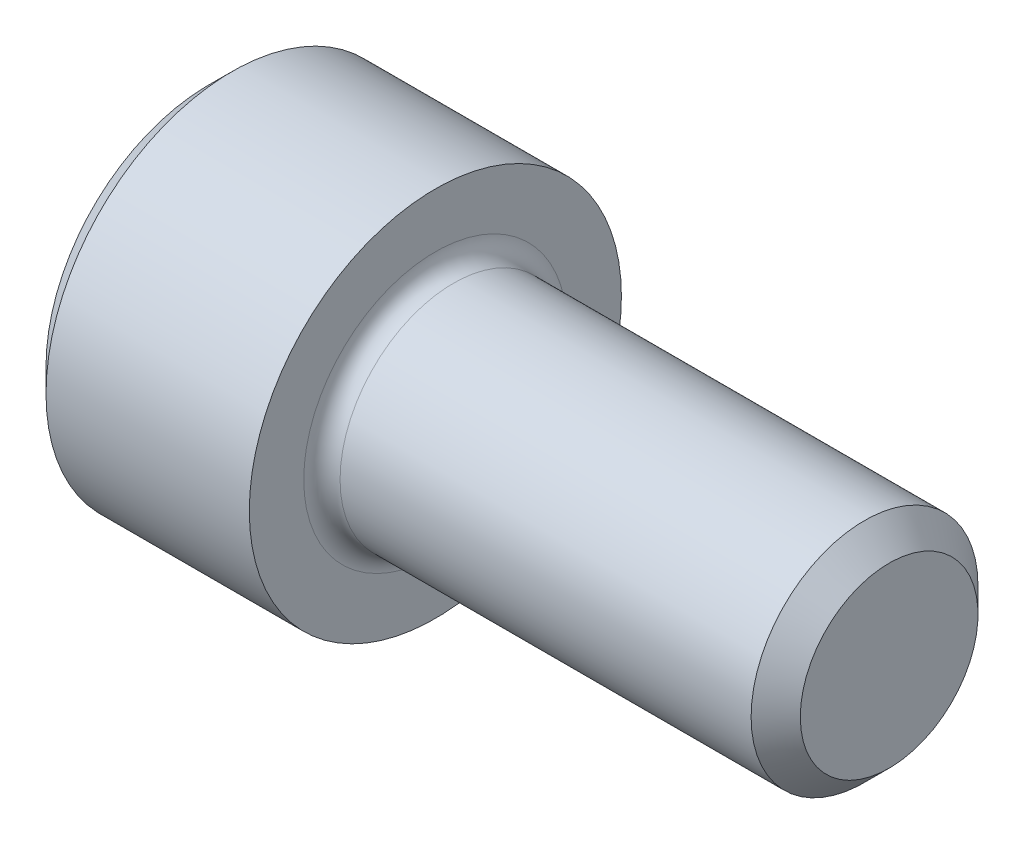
ISO-10303-21;
HEADER;
FILE_DESCRIPTION(('STEP AP214'),'2;1');
FILE_NAME('part.step','',(''),(''),'','','');
FILE_SCHEMA(('AUTOMOTIVE_DESIGN { 1 0 10303 214 1 1 1 1 }'));
ENDSEC;
DATA;
#1=APPLICATION_CONTEXT('core data for automotive mechanical design processes');
#2=APPLICATION_PROTOCOL_DEFINITION('international standard','automotive_design',2000,#1);
#3=PRODUCT_CONTEXT('',#1,'mechanical');
#4=PRODUCT('Part','Part','',(#3));
#5=PRODUCT_RELATED_PRODUCT_CATEGORY('part','',(#4));
#6=PRODUCT_DEFINITION_FORMATION('','',#4);
#7=PRODUCT_DEFINITION_CONTEXT('part definition',#1,'design');
#8=PRODUCT_DEFINITION('design','',#6,#7);
#9=PRODUCT_DEFINITION_SHAPE('','',#8);
#10=(LENGTH_UNIT() NAMED_UNIT(*) SI_UNIT(.MILLI.,.METRE.));
#11=(NAMED_UNIT(*) PLANE_ANGLE_UNIT() SI_UNIT($,.RADIAN.));
#12=(NAMED_UNIT(*) SI_UNIT($,.STERADIAN.) SOLID_ANGLE_UNIT());
#13=UNCERTAINTY_MEASURE_WITH_UNIT(LENGTH_MEASURE(1.E-05),#10,'distance_accuracy_value','');
#14=(GEOMETRIC_REPRESENTATION_CONTEXT(3) GLOBAL_UNCERTAINTY_ASSIGNED_CONTEXT((#13)) GLOBAL_UNIT_ASSIGNED_CONTEXT((#10,
#11,#12)) REPRESENTATION_CONTEXT('',''));
#15=CARTESIAN_POINT('',(0.,0.,0.));
#16=DIRECTION('',(0.,0.,1.));
#17=DIRECTION('',(1.,0.,0.));
#18=AXIS2_PLACEMENT_3D('',#15,#16,#17);
#19=CARTESIAN_POINT('',(0.,0.,0.));
#20=DIRECTION('',(-1.,0.,0.));
#21=DIRECTION('',(0.,0.,1.));
#22=AXIS2_PLACEMENT_3D('',#19,#20,#21);
#23=PLANE('',#22);
#24=DIRECTION('',(0.,-0.499999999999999,0.866025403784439));
#25=VECTOR('',#24,1.);
#26=CARTESIAN_POINT('',(0.,1.37848150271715,0.));
#27=LINE('',#26,#25);
#28=CARTESIAN_POINT('',(0.,1.37848150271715,0.));
#29=VERTEX_POINT('',#28);
#30=CARTESIAN_POINT('',(0.,0.689240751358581,1.1938));
#31=VERTEX_POINT('',#30);
#32=EDGE_CURVE('E111',#29,#31,#27,.T.);
#33=ORIENTED_EDGE('',*,*,#32,.T.);
#34=DIRECTION('',(0.,1.,0.));
#35=VECTOR('',#34,1.);
#36=CARTESIAN_POINT('',(0.,-0.689240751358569,1.1938));
#37=LINE('',#36,#35);
#38=CARTESIAN_POINT('',(0.,-0.689240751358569,1.1938));
#39=VERTEX_POINT('',#38);
#40=EDGE_CURVE('E100',#39,#31,#37,.T.);
#41=ORIENTED_EDGE('',*,*,#40,.F.);
#42=DIRECTION('',(0.,-0.500000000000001,-0.866025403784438));
#43=VECTOR('',#42,1.);
#44=CARTESIAN_POINT('',(0.,-0.689240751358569,1.1938));
#45=LINE('',#44,#43);
#46=CARTESIAN_POINT('',(0.,-1.37848150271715,0.));
#47=VERTEX_POINT('',#46);
#48=EDGE_CURVE('E110',#39,#47,#45,.T.);
#49=ORIENTED_EDGE('',*,*,#48,.T.);
#50=DIRECTION('',(0.,0.499999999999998,-0.86602540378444));
#51=VECTOR('',#50,1.);
#52=CARTESIAN_POINT('',(0.,-1.37848150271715,0.));
#53=LINE('',#52,#51);
#54=CARTESIAN_POINT('',(0.,-0.689240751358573,-1.1938));
#55=VERTEX_POINT('',#54);
#56=EDGE_CURVE('E125',#47,#55,#53,.T.);
#57=ORIENTED_EDGE('',*,*,#56,.T.);
#58=DIRECTION('',(0.,-1.,0.));
#59=VECTOR('',#58,1.);
#60=CARTESIAN_POINT('',(0.,0.689240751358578,-1.1938));
#61=LINE('',#60,#59);
#62=CARTESIAN_POINT('',(0.,0.689240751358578,-1.1938));
#63=VERTEX_POINT('',#62);
#64=EDGE_CURVE('E128',#63,#55,#61,.T.);
#65=ORIENTED_EDGE('',*,*,#64,.F.);
#66=DIRECTION('',(0.,-0.500000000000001,-0.866025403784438));
#67=VECTOR('',#66,1.);
#68=CARTESIAN_POINT('',(0.,1.37848150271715,0.));
#69=LINE('',#68,#67);
#70=EDGE_CURVE('E120',#29,#63,#69,.T.);
#71=ORIENTED_EDGE('',*,*,#70,.F.);
#72=EDGE_LOOP('',(#33,#41,#49,#57,#65,#71));
#73=FACE_BOUND('',#72,.T.);
#74=CARTESIAN_POINT('',(0.,0.,0.));
#75=DIRECTION('',(-1.,0.,0.));
#76=DIRECTION('',(0.,0.,1.));
#77=AXIS2_PLACEMENT_3D('',#74,#75,#76);
#78=CIRCLE('',#77,2.2733);
#79=CARTESIAN_POINT('',(0.,0.,2.2733));
#80=VERTEX_POINT('',#79);
#81=EDGE_CURVE('E180',#80,#80,#78,.T.);
#82=ORIENTED_EDGE('',*,*,#81,.T.);
#83=EDGE_LOOP('',(#82));
#84=FACE_BOUND('',#83,.T.);
#85=ADVANCED_FACE('F28',(#73,#84),#23,.T.);
#86=CARTESIAN_POINT('',(0.,0.,0.));
#87=DIRECTION('',(1.,0.,0.));
#88=DIRECTION('',(0.,0.,-1.));
#89=AXIS2_PLACEMENT_3D('',#86,#87,#88);
#90=CONICAL_SURFACE('',#89,2.2733,0.785398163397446);
#91=CARTESIAN_POINT('',(0.330200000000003,0.,0.));
#92=DIRECTION('',(-1.,0.,0.));
#93=DIRECTION('',(0.,0.,1.));
#94=AXIS2_PLACEMENT_3D('',#91,#92,#93);
#95=CIRCLE('',#94,2.6035);
#96=CARTESIAN_POINT('',(0.330200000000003,0.,2.6035));
#97=VERTEX_POINT('',#96);
#98=EDGE_CURVE('E177',#97,#97,#95,.T.);
#99=ORIENTED_EDGE('',*,*,#98,.T.);
#100=EDGE_LOOP('',(#99));
#101=FACE_BOUND('',#100,.T.);
#102=ORIENTED_EDGE('',*,*,#81,.F.);
#103=EDGE_LOOP('',(#102));
#104=FACE_BOUND('',#103,.T.);
#105=ADVANCED_FACE('F205',(#101,#104),#90,.T.);
#106=CARTESIAN_POINT('',(-31.75,0.,0.));
#107=DIRECTION('',(-1.,0.,0.));
#108=DIRECTION('',(0.,0.,1.));
#109=AXIS2_PLACEMENT_3D('',#106,#107,#108);
#110=CYLINDRICAL_SURFACE('',#109,2.6035);
#111=CARTESIAN_POINT('',(3.175,0.,0.));
#112=DIRECTION('',(-1.,0.,0.));
#113=DIRECTION('',(0.,0.,1.));
#114=AXIS2_PLACEMENT_3D('',#111,#112,#113);
#115=CIRCLE('',#114,2.6035);
#116=CARTESIAN_POINT('',(3.175,0.,2.6035));
#117=VERTEX_POINT('',#116);
#118=EDGE_CURVE('E174',#117,#117,#115,.T.);
#119=ORIENTED_EDGE('',*,*,#118,.T.);
#120=EDGE_LOOP('',(#119));
#121=FACE_BOUND('',#120,.T.);
#122=ORIENTED_EDGE('',*,*,#98,.F.);
#123=EDGE_LOOP('',(#122));
#124=FACE_BOUND('',#123,.T.);
#125=ADVANCED_FACE('F209',(#121,#124),#110,.T.);
#126=CARTESIAN_POINT('',(3.175,2.6035,0.));
#127=DIRECTION('',(1.,0.,0.));
#128=DIRECTION('',(0.,0.,-1.));
#129=AXIS2_PLACEMENT_3D('',#126,#127,#128);
#130=PLANE('',#129);
#131=CARTESIAN_POINT('',(3.175,0.,0.));
#132=DIRECTION('',(1.,0.,0.));
#133=DIRECTION('',(0.,0.,-1.));
#134=AXIS2_PLACEMENT_3D('',#131,#132,#133);
#135=CIRCLE('',#134,1.8415);
#136=CARTESIAN_POINT('',(3.175,0.,-1.8415));
#137=VERTEX_POINT('',#136);
#138=EDGE_CURVE('E35',#137,#137,#135,.F.);
#139=ORIENTED_EDGE('',*,*,#138,.T.);
#140=EDGE_LOOP('',(#139));
#141=FACE_BOUND('',#140,.T.);
#142=ORIENTED_EDGE('',*,*,#118,.F.);
#143=EDGE_LOOP('',(#142));
#144=FACE_BOUND('',#143,.T.);
#145=ADVANCED_FACE('F185',(#141,#144),#130,.T.);
#146=CARTESIAN_POINT('',(-31.75,0.,0.));
#147=DIRECTION('',(-1.,0.,0.));
#148=DIRECTION('',(0.,0.,1.));
#149=AXIS2_PLACEMENT_3D('',#146,#147,#148);
#150=CYLINDRICAL_SURFACE('',#149,1.5875);
#151=CARTESIAN_POINT('',(3.429,0.,0.));
#152=DIRECTION('',(1.,0.,0.));
#153=DIRECTION('',(0.,0.,-1.));
#154=AXIS2_PLACEMENT_3D('',#151,#152,#153);
#155=CIRCLE('',#154,1.5875);
#156=CARTESIAN_POINT('',(3.429,0.,-1.5875));
#157=VERTEX_POINT('',#156);
#158=EDGE_CURVE('E11',#157,#157,#155,.T.);
#159=ORIENTED_EDGE('',*,*,#158,.T.);
#160=EDGE_LOOP('',(#159));
#161=FACE_BOUND('',#160,.T.);
#162=CARTESIAN_POINT('',(9.18083,0.,0.));
#163=DIRECTION('',(-1.,0.,0.));
#164=DIRECTION('',(0.,0.,1.));
#165=AXIS2_PLACEMENT_3D('',#162,#163,#164);
#166=CIRCLE('',#165,1.5875);
#167=CARTESIAN_POINT('',(9.18083,0.,1.5875));
#168=VERTEX_POINT('',#167);
#169=EDGE_CURVE('E171',#168,#168,#166,.T.);
#170=ORIENTED_EDGE('',*,*,#169,.T.);
#171=EDGE_LOOP('',(#170));
#172=FACE_BOUND('',#171,.T.);
#173=ADVANCED_FACE('F220',(#161,#172),#150,.T.);
#174=CARTESIAN_POINT('',(9.525,0.,0.));
#175=DIRECTION('',(-1.,0.,0.));
#176=DIRECTION('',(0.,0.,1.));
#177=AXIS2_PLACEMENT_3D('',#174,#175,#176);
#178=CONICAL_SURFACE('',#177,1.24333,0.785398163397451);
#179=ORIENTED_EDGE('',*,*,#169,.F.);
#180=EDGE_LOOP('',(#179));
#181=FACE_BOUND('',#180,.T.);
#182=CARTESIAN_POINT('',(9.525,0.,0.));
#183=DIRECTION('',(-1.,0.,0.));
#184=DIRECTION('',(0.,0.,1.));
#185=AXIS2_PLACEMENT_3D('',#182,#183,#184);
#186=CIRCLE('',#185,1.24333);
#187=CARTESIAN_POINT('',(9.525,0.,1.24333));
#188=VERTEX_POINT('',#187);
#189=EDGE_CURVE('E167',#188,#188,#186,.T.);
#190=ORIENTED_EDGE('',*,*,#189,.T.);
#191=EDGE_LOOP('',(#190));
#192=FACE_BOUND('',#191,.T.);
#193=ADVANCED_FACE('F200',(#181,#192),#178,.T.);
#194=CARTESIAN_POINT('',(9.525,1.24333,0.));
#195=DIRECTION('',(1.,0.,0.));
#196=DIRECTION('',(0.,0.,-1.));
#197=AXIS2_PLACEMENT_3D('',#194,#195,#196);
#198=PLANE('',#197);
#199=ORIENTED_EDGE('',*,*,#189,.F.);
#200=EDGE_LOOP('',(#199));
#201=FACE_BOUND('',#200,.T.);
#202=ADVANCED_FACE('F190',(#201),#198,.T.);
#203=CARTESIAN_POINT('',(3.429,0.,0.));
#204=DIRECTION('',(1.,0.,0.));
#205=DIRECTION('',(0.,0.,-1.));
#206=AXIS2_PLACEMENT_3D('',#203,#204,#205);
#207=TOROIDAL_SURFACE('',#206,1.8415,0.254);
#208=ORIENTED_EDGE('',*,*,#158,.F.);
#209=EDGE_LOOP('',(#208));
#210=FACE_BOUND('',#209,.T.);
#211=ORIENTED_EDGE('',*,*,#138,.F.);
#212=EDGE_LOOP('',(#211));
#213=FACE_BOUND('',#212,.T.);
#214=ADVANCED_FACE('F188',(#210,#213),#207,.F.);
#215=CARTESIAN_POINT('',(1.4478,1.37848150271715,0.));
#216=DIRECTION('',(0.,-0.866025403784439,-0.499999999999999));
#217=DIRECTION('',(0.,0.499999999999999,-0.866025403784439));
#218=AXIS2_PLACEMENT_3D('',#215,#216,#217);
#219=PLANE('',#218);
#220=ORIENTED_EDGE('',*,*,#32,.F.);
#221=DIRECTION('',(-1.,0.,0.));
#222=VECTOR('',#221,1.);
#223=CARTESIAN_POINT('',(1.4478,1.37848150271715,0.));
#224=LINE('',#223,#222);
#225=CARTESIAN_POINT('',(1.4478,1.37848150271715,0.));
#226=VERTEX_POINT('',#225);
#227=EDGE_CURVE('E152',#226,#29,#224,.T.);
#228=ORIENTED_EDGE('',*,*,#227,.F.);
#229=DIRECTION('',(0.,-0.499999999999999,0.866025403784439));
#230=VECTOR('',#229,1.);
#231=CARTESIAN_POINT('',(1.4478,1.37848150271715,0.));
#232=LINE('',#231,#230);
#233=CARTESIAN_POINT('',(1.4478,1.03386112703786,0.596899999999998));
#234=VERTEX_POINT('',#233);
#235=EDGE_CURVE('E42',#226,#234,#232,.T.);
#236=ORIENTED_EDGE('',*,*,#235,.T.);
#237=CARTESIAN_POINT('',(1.4478,0.689240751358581,1.1938));
#238=VERTEX_POINT('',#237);
#239=EDGE_CURVE('E115',#234,#238,#232,.T.);
#240=ORIENTED_EDGE('',*,*,#239,.T.);
#241=DIRECTION('',(-1.,0.,0.));
#242=VECTOR('',#241,1.);
#243=CARTESIAN_POINT('',(1.4478,0.689240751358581,1.1938));
#244=LINE('',#243,#242);
#245=EDGE_CURVE('E104',#238,#31,#244,.T.);
#246=ORIENTED_EDGE('',*,*,#245,.T.);
#247=EDGE_LOOP('',(#220,#228,#236,#240,#246));
#248=FACE_BOUND('',#247,.T.);
#249=ADVANCED_FACE('F113',(#248),#219,.T.);
#250=CARTESIAN_POINT('',(1.4478,-0.689240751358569,1.1938));
#251=DIRECTION('',(0.,0.,1.));
#252=DIRECTION('',(0.,-1.,0.));
#253=AXIS2_PLACEMENT_3D('',#250,#251,#252);
#254=PLANE('',#253);
#255=ORIENTED_EDGE('',*,*,#40,.T.);
#256=ORIENTED_EDGE('',*,*,#245,.F.);
#257=DIRECTION('',(0.,1.,0.));
#258=VECTOR('',#257,1.);
#259=CARTESIAN_POINT('',(1.4478,-0.689240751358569,1.1938));
#260=LINE('',#259,#258);
#261=CARTESIAN_POINT('',(1.4478,0.,1.1938));
#262=VERTEX_POINT('',#261);
#263=EDGE_CURVE('E132',#262,#238,#260,.T.);
#264=ORIENTED_EDGE('',*,*,#263,.F.);
#265=CARTESIAN_POINT('',(1.4478,-0.689240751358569,1.1938));
#266=VERTEX_POINT('',#265);
#267=EDGE_CURVE('E133',#266,#262,#260,.T.);
#268=ORIENTED_EDGE('',*,*,#267,.F.);
#269=DIRECTION('',(-1.,0.,0.));
#270=VECTOR('',#269,1.);
#271=CARTESIAN_POINT('',(1.4478,-0.689240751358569,1.1938));
#272=LINE('',#271,#270);
#273=EDGE_CURVE('E106',#266,#39,#272,.T.);
#274=ORIENTED_EDGE('',*,*,#273,.T.);
#275=EDGE_LOOP('',(#255,#256,#264,#268,#274));
#276=FACE_BOUND('',#275,.T.);
#277=ADVANCED_FACE('F102',(#276),#254,.F.);
#278=CARTESIAN_POINT('',(1.4478,-0.689240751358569,1.1938));
#279=DIRECTION('',(0.,0.866025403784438,-0.500000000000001));
#280=DIRECTION('',(0.,0.500000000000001,0.866025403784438));
#281=AXIS2_PLACEMENT_3D('',#278,#279,#280);
#282=PLANE('',#281);
#283=ORIENTED_EDGE('',*,*,#48,.F.);
#284=ORIENTED_EDGE('',*,*,#273,.F.);
#285=DIRECTION('',(0.,-0.500000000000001,-0.866025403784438));
#286=VECTOR('',#285,1.);
#287=CARTESIAN_POINT('',(1.4478,-0.689240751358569,1.1938));
#288=LINE('',#287,#286);
#289=CARTESIAN_POINT('',(1.4478,-1.03386112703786,0.596899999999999));
#290=VERTEX_POINT('',#289);
#291=EDGE_CURVE('E137',#266,#290,#288,.T.);
#292=ORIENTED_EDGE('',*,*,#291,.T.);
#293=CARTESIAN_POINT('',(1.4478,-1.37848150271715,0.));
#294=VERTEX_POINT('',#293);
#295=EDGE_CURVE('E136',#290,#294,#288,.T.);
#296=ORIENTED_EDGE('',*,*,#295,.T.);
#297=DIRECTION('',(-1.,0.,0.));
#298=VECTOR('',#297,1.);
#299=CARTESIAN_POINT('',(1.4478,-1.37848150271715,0.));
#300=LINE('',#299,#298);
#301=EDGE_CURVE('E160',#294,#47,#300,.T.);
#302=ORIENTED_EDGE('',*,*,#301,.T.);
#303=EDGE_LOOP('',(#283,#284,#292,#296,#302));
#304=FACE_BOUND('',#303,.T.);
#305=ADVANCED_FACE('F272',(#304),#282,.T.);
#306=CARTESIAN_POINT('',(1.4478,-1.37848150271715,0.));
#307=DIRECTION('',(0.,0.866025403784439,0.499999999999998));
#308=DIRECTION('',(0.,-0.499999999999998,0.86602540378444));
#309=AXIS2_PLACEMENT_3D('',#306,#307,#308);
#310=PLANE('',#309);
#311=ORIENTED_EDGE('',*,*,#56,.F.);
#312=ORIENTED_EDGE('',*,*,#301,.F.);
#313=DIRECTION('',(0.,0.499999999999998,-0.86602540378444));
#314=VECTOR('',#313,1.);
#315=CARTESIAN_POINT('',(1.4478,-1.37848150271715,0.));
#316=LINE('',#315,#314);
#317=CARTESIAN_POINT('',(1.4478,-1.03386112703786,-0.596899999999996));
#318=VERTEX_POINT('',#317);
#319=EDGE_CURVE('E141',#294,#318,#316,.T.);
#320=ORIENTED_EDGE('',*,*,#319,.T.);
#321=CARTESIAN_POINT('',(1.4478,-0.689240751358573,-1.1938));
#322=VERTEX_POINT('',#321);
#323=EDGE_CURVE('E140',#318,#322,#316,.T.);
#324=ORIENTED_EDGE('',*,*,#323,.T.);
#325=DIRECTION('',(-1.,0.,0.));
#326=VECTOR('',#325,1.);
#327=CARTESIAN_POINT('',(1.4478,-0.689240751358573,-1.1938));
#328=LINE('',#327,#326);
#329=EDGE_CURVE('E157',#322,#55,#328,.T.);
#330=ORIENTED_EDGE('',*,*,#329,.T.);
#331=EDGE_LOOP('',(#311,#312,#320,#324,#330));
#332=FACE_BOUND('',#331,.T.);
#333=ADVANCED_FACE('F279',(#332),#310,.T.);
#334=CARTESIAN_POINT('',(1.4478,0.689240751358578,-1.1938));
#335=DIRECTION('',(0.,0.,-1.));
#336=DIRECTION('',(0.,1.,0.));
#337=AXIS2_PLACEMENT_3D('',#334,#335,#336);
#338=PLANE('',#337);
#339=ORIENTED_EDGE('',*,*,#64,.T.);
#340=ORIENTED_EDGE('',*,*,#329,.F.);
#341=DIRECTION('',(0.,-1.,0.));
#342=VECTOR('',#341,1.);
#343=CARTESIAN_POINT('',(1.4478,0.689240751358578,-1.1938));
#344=LINE('',#343,#342);
#345=CARTESIAN_POINT('',(1.4478,0.,-1.1938));
#346=VERTEX_POINT('',#345);
#347=EDGE_CURVE('E144',#346,#322,#344,.T.);
#348=ORIENTED_EDGE('',*,*,#347,.F.);
#349=CARTESIAN_POINT('',(1.4478,0.689240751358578,-1.1938));
#350=VERTEX_POINT('',#349);
#351=EDGE_CURVE('E145',#350,#346,#344,.T.);
#352=ORIENTED_EDGE('',*,*,#351,.F.);
#353=DIRECTION('',(-1.,0.,0.));
#354=VECTOR('',#353,1.);
#355=CARTESIAN_POINT('',(1.4478,0.689240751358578,-1.1938));
#356=LINE('',#355,#354);
#357=EDGE_CURVE('E154',#350,#63,#356,.T.);
#358=ORIENTED_EDGE('',*,*,#357,.T.);
#359=EDGE_LOOP('',(#339,#340,#348,#352,#358));
#360=FACE_BOUND('',#359,.T.);
#361=ADVANCED_FACE('F287',(#360),#338,.F.);
#362=CARTESIAN_POINT('',(1.4478,1.37848150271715,0.));
#363=DIRECTION('',(0.,0.866025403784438,-0.500000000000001));
#364=DIRECTION('',(0.,0.500000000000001,0.866025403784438));
#365=AXIS2_PLACEMENT_3D('',#362,#363,#364);
#366=PLANE('',#365);
#367=ORIENTED_EDGE('',*,*,#70,.T.);
#368=ORIENTED_EDGE('',*,*,#357,.F.);
#369=DIRECTION('',(0.,-0.500000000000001,-0.866025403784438));
#370=VECTOR('',#369,1.);
#371=CARTESIAN_POINT('',(1.4478,1.37848150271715,0.));
#372=LINE('',#371,#370);
#373=CARTESIAN_POINT('',(1.4478,1.03386112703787,-0.596900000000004));
#374=VERTEX_POINT('',#373);
#375=EDGE_CURVE('E148',#374,#350,#372,.T.);
#376=ORIENTED_EDGE('',*,*,#375,.F.);
#377=EDGE_CURVE('E149',#226,#374,#372,.T.);
#378=ORIENTED_EDGE('',*,*,#377,.F.);
#379=ORIENTED_EDGE('',*,*,#227,.T.);
#380=EDGE_LOOP('',(#367,#368,#376,#378,#379));
#381=FACE_BOUND('',#380,.T.);
#382=ADVANCED_FACE('F295',(#381),#366,.F.);
#383=CARTESIAN_POINT('',(1.4478,0.689240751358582,1.1938));
#384=DIRECTION('',(-1.,0.,0.));
#385=DIRECTION('',(0.,0.,1.));
#386=AXIS2_PLACEMENT_3D('',#383,#384,#385);
#387=PLANE('',#386);
#388=CARTESIAN_POINT('',(1.4478,0.,0.));
#389=DIRECTION('',(-1.,0.,0.));
#390=DIRECTION('',(0.,0.,1.));
#391=AXIS2_PLACEMENT_3D('',#388,#389,#390);
#392=CIRCLE('',#391,1.1938);
#393=EDGE_CURVE('E116',#290,#262,#392,.T.);
#394=ORIENTED_EDGE('',*,*,#393,.F.);
#395=ORIENTED_EDGE('',*,*,#291,.F.);
#396=ORIENTED_EDGE('',*,*,#267,.T.);
#397=EDGE_LOOP('',(#394,#395,#396));
#398=FACE_BOUND('',#397,.T.);
#399=ADVANCED_FACE('F303',(#398),#387,.T.);
#400=EDGE_CURVE('E354',#318,#290,#392,.T.);
#401=ORIENTED_EDGE('',*,*,#400,.F.);
#402=ORIENTED_EDGE('',*,*,#319,.F.);
#403=ORIENTED_EDGE('',*,*,#295,.F.);
#404=EDGE_LOOP('',(#401,#402,#403));
#405=FACE_BOUND('',#404,.T.);
#406=ADVANCED_FACE('F311',(#405),#387,.T.);
#407=EDGE_CURVE('E355',#346,#318,#392,.T.);
#408=ORIENTED_EDGE('',*,*,#407,.F.);
#409=ORIENTED_EDGE('',*,*,#347,.T.);
#410=ORIENTED_EDGE('',*,*,#323,.F.);
#411=EDGE_LOOP('',(#408,#409,#410));
#412=FACE_BOUND('',#411,.T.);
#413=ADVANCED_FACE('F319',(#412),#387,.T.);
#414=EDGE_CURVE('E356',#374,#346,#392,.T.);
#415=ORIENTED_EDGE('',*,*,#414,.F.);
#416=ORIENTED_EDGE('',*,*,#375,.T.);
#417=ORIENTED_EDGE('',*,*,#351,.T.);
#418=EDGE_LOOP('',(#415,#416,#417));
#419=FACE_BOUND('',#418,.T.);
#420=ADVANCED_FACE('F326',(#419),#387,.T.);
#421=EDGE_CURVE('E168',#234,#374,#392,.T.);
#422=ORIENTED_EDGE('',*,*,#421,.F.);
#423=ORIENTED_EDGE('',*,*,#235,.F.);
#424=ORIENTED_EDGE('',*,*,#377,.T.);
#425=EDGE_LOOP('',(#422,#423,#424));
#426=FACE_BOUND('',#425,.T.);
#427=ADVANCED_FACE('F333',(#426),#387,.T.);
#428=EDGE_CURVE('E164',#262,#234,#392,.T.);
#429=ORIENTED_EDGE('',*,*,#428,.F.);
#430=ORIENTED_EDGE('',*,*,#263,.T.);
#431=ORIENTED_EDGE('',*,*,#239,.F.);
#432=EDGE_LOOP('',(#429,#430,#431));
#433=FACE_BOUND('',#432,.T.);
#434=ADVANCED_FACE('F258',(#433),#387,.T.);
#435=CARTESIAN_POINT('',(1.4478,0.,0.));
#436=DIRECTION('',(-1.,0.,0.));
#437=DIRECTION('',(0.,0.,1.));
#438=AXIS2_PLACEMENT_3D('',#435,#436,#437);
#439=CONICAL_SURFACE('',#438,1.1938,1.04719755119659);
#440=CARTESIAN_POINT('',(2.13704075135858,0.,0.));
#441=VERTEX_POINT('',#440);
#442=VERTEX_LOOP('',#441);
#443=FACE_BOUND('',#442,.T.);
#444=ORIENTED_EDGE('',*,*,#428,.T.);
#445=ORIENTED_EDGE('',*,*,#421,.T.);
#446=ORIENTED_EDGE('',*,*,#414,.T.);
#447=ORIENTED_EDGE('',*,*,#407,.T.);
#448=ORIENTED_EDGE('',*,*,#400,.T.);
#449=ORIENTED_EDGE('',*,*,#393,.T.);
#450=EDGE_LOOP('',(#444,#445,#446,#447,#448,#449));
#451=FACE_BOUND('',#450,.T.);
#452=ADVANCED_FACE('F254',(#443,#451),#439,.F.);
#453=CLOSED_SHELL('',(#85,#105,#125,#145,#173,#193,#202,#214,#249,#277,#305,#333,#361,#382,#399,
#406,#413,#420,#427,#434,#452));
#454=MANIFOLD_SOLID_BREP('B2',#453);
#455=ADVANCED_BREP_SHAPE_REPRESENTATION('',(#18,#454),#14);
#456=SHAPE_DEFINITION_REPRESENTATION(#9,#455);
ENDSEC;
END-ISO-10303-21;
